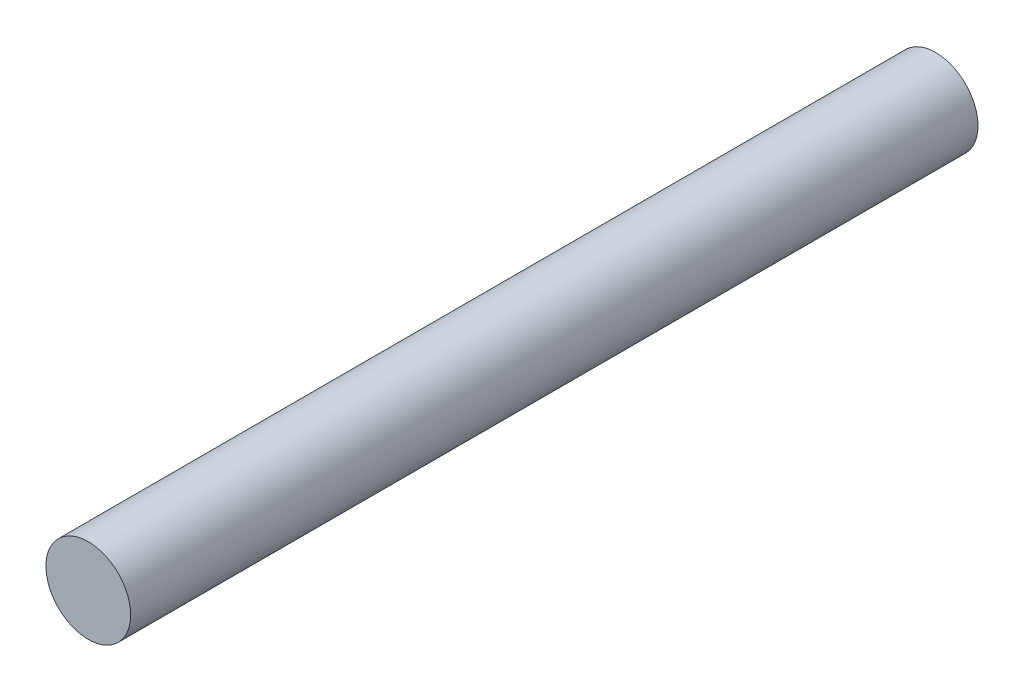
ISO-10303-21;
HEADER;
FILE_DESCRIPTION(('STEP AP214'),'2;1');
FILE_NAME('part.step','',(''),(''),'','','');
FILE_SCHEMA(('AUTOMOTIVE_DESIGN { 1 0 10303 214 1 1 1 1 }'));
ENDSEC;
DATA;
#1=APPLICATION_CONTEXT('core data for automotive mechanical design processes');
#2=APPLICATION_PROTOCOL_DEFINITION('international standard','automotive_design',2000,#1);
#3=PRODUCT_CONTEXT('',#1,'mechanical');
#4=PRODUCT('Part','Part','',(#3));
#5=PRODUCT_RELATED_PRODUCT_CATEGORY('part','',(#4));
#6=PRODUCT_DEFINITION_FORMATION('','',#4);
#7=PRODUCT_DEFINITION_CONTEXT('part definition',#1,'design');
#8=PRODUCT_DEFINITION('design','',#6,#7);
#9=PRODUCT_DEFINITION_SHAPE('','',#8);
#10=(LENGTH_UNIT() NAMED_UNIT(*) SI_UNIT(.MILLI.,.METRE.));
#11=(NAMED_UNIT(*) PLANE_ANGLE_UNIT() SI_UNIT($,.RADIAN.));
#12=(NAMED_UNIT(*) SI_UNIT($,.STERADIAN.) SOLID_ANGLE_UNIT());
#13=UNCERTAINTY_MEASURE_WITH_UNIT(LENGTH_MEASURE(1.E-05),#10,'distance_accuracy_value','');
#14=(GEOMETRIC_REPRESENTATION_CONTEXT(3) GLOBAL_UNCERTAINTY_ASSIGNED_CONTEXT((#13)) GLOBAL_UNIT_ASSIGNED_CONTEXT((#10,
#11,#12)) REPRESENTATION_CONTEXT('',''));
#15=CARTESIAN_POINT('',(0.,0.,0.));
#16=DIRECTION('',(0.,0.,1.));
#17=DIRECTION('',(1.,0.,0.));
#18=AXIS2_PLACEMENT_3D('',#15,#16,#17);
#19=CARTESIAN_POINT('',(-3.75000000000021,-12.,50.));
#20=DIRECTION('',(0.,0.,-1.));
#21=DIRECTION('',(-1.,0.,0.));
#22=AXIS2_PLACEMENT_3D('',#19,#20,#21);
#23=CYLINDRICAL_SURFACE('',#22,2.5);
#24=CARTESIAN_POINT('',(-3.75000000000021,-12.,50.));
#25=DIRECTION('',(0.,0.,1.));
#26=DIRECTION('',(1.,0.,0.));
#27=AXIS2_PLACEMENT_3D('',#24,#25,#26);
#28=CIRCLE('',#27,2.5);
#29=CARTESIAN_POINT('',(-1.25000000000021,-12.,50.));
#30=VERTEX_POINT('',#29);
#31=EDGE_CURVE('E11',#30,#30,#28,.T.);
#32=ORIENTED_EDGE('',*,*,#31,.F.);
#33=EDGE_LOOP('',(#32));
#34=FACE_BOUND('',#33,.T.);
#35=CARTESIAN_POINT('',(-3.75000000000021,-12.,0.));
#36=DIRECTION('',(0.,0.,1.));
#37=DIRECTION('',(1.,0.,0.));
#38=AXIS2_PLACEMENT_3D('',#35,#36,#37);
#39=CIRCLE('',#38,2.5);
#40=CARTESIAN_POINT('',(-1.25000000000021,-12.,0.));
#41=VERTEX_POINT('',#40);
#42=EDGE_CURVE('E19',#41,#41,#39,.T.);
#43=ORIENTED_EDGE('',*,*,#42,.T.);
#44=EDGE_LOOP('',(#43));
#45=FACE_BOUND('',#44,.T.);
#46=ADVANCED_FACE('F16',(#34,#45),#23,.T.);
#47=CARTESIAN_POINT('',(-3.75000000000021,-12.,50.));
#48=DIRECTION('',(0.,0.,1.));
#49=DIRECTION('',(1.,0.,0.));
#50=AXIS2_PLACEMENT_3D('',#47,#48,#49);
#51=PLANE('',#50);
#52=ORIENTED_EDGE('',*,*,#31,.T.);
#53=EDGE_LOOP('',(#52));
#54=FACE_BOUND('',#53,.T.);
#55=ADVANCED_FACE('F45',(#54),#51,.T.);
#56=CARTESIAN_POINT('',(-3.75000000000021,-12.,0.));
#57=DIRECTION('',(0.,0.,1.));
#58=DIRECTION('',(1.,0.,0.));
#59=AXIS2_PLACEMENT_3D('',#56,#57,#58);
#60=PLANE('',#59);
#61=CARTESIAN_POINT('',(-3.75000000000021,-12.,0.));
#62=DIRECTION('',(0.,0.,-1.));
#63=DIRECTION('',(-1.,0.,0.));
#64=AXIS2_PLACEMENT_3D('',#61,#62,#63);
#65=CIRCLE('',#64,1.25);
#66=CARTESIAN_POINT('',(-5.00000000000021,-12.,0.));
#67=VERTEX_POINT('',#66);
#68=EDGE_CURVE('E35',#67,#67,#65,.T.);
#69=ORIENTED_EDGE('',*,*,#68,.F.);
#70=EDGE_LOOP('',(#69));
#71=FACE_BOUND('',#70,.T.);
#72=ORIENTED_EDGE('',*,*,#42,.F.);
#73=EDGE_LOOP('',(#72));
#74=FACE_BOUND('',#73,.T.);
#75=ADVANCED_FACE('F29',(#71,#74),#60,.F.);
#76=CARTESIAN_POINT('',(-3.75000000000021,-12.,14.5));
#77=DIRECTION('',(0.,0.,-1.));
#78=DIRECTION('',(-1.,0.,0.));
#79=AXIS2_PLACEMENT_3D('',#76,#77,#78);
#80=CONICAL_SURFACE('',#79,1.25,1.02974425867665);
#81=CARTESIAN_POINT('',(-3.75000000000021,-12.,15.2510757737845));
#82=VERTEX_POINT('',#81);
#83=VERTEX_LOOP('',#82);
#84=FACE_BOUND('',#83,.T.);
#85=CARTESIAN_POINT('',(-3.75000000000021,-12.,14.5));
#86=DIRECTION('',(0.,0.,-1.));
#87=DIRECTION('',(-1.,0.,0.));
#88=AXIS2_PLACEMENT_3D('',#85,#86,#87);
#89=CIRCLE('',#88,1.25);
#90=CARTESIAN_POINT('',(-5.00000000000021,-12.,14.5));
#91=VERTEX_POINT('',#90);
#92=EDGE_CURVE('E33',#91,#91,#89,.T.);
#93=ORIENTED_EDGE('',*,*,#92,.T.);
#94=EDGE_LOOP('',(#93));
#95=FACE_BOUND('',#94,.T.);
#96=ADVANCED_FACE('F25',(#84,#95),#80,.F.);
#97=CARTESIAN_POINT('',(-3.75000000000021,-12.,0.));
#98=DIRECTION('',(0.,0.,-1.));
#99=DIRECTION('',(-1.,0.,0.));
#100=AXIS2_PLACEMENT_3D('',#97,#98,#99);
#101=CYLINDRICAL_SURFACE('',#100,1.25);
#102=ORIENTED_EDGE('',*,*,#92,.F.);
#103=EDGE_LOOP('',(#102));
#104=FACE_BOUND('',#103,.T.);
#105=ORIENTED_EDGE('',*,*,#68,.T.);
#106=EDGE_LOOP('',(#105));
#107=FACE_BOUND('',#106,.T.);
#108=ADVANCED_FACE('F28',(#104,#107),#101,.F.);
#109=CLOSED_SHELL('',(#46,#55,#75,#96,#108));
#110=MANIFOLD_SOLID_BREP('B1',#109);
#111=ADVANCED_BREP_SHAPE_REPRESENTATION('',(#18,#110),#14);
#112=SHAPE_DEFINITION_REPRESENTATION(#9,#111);
ENDSEC;
END-ISO-10303-21;
